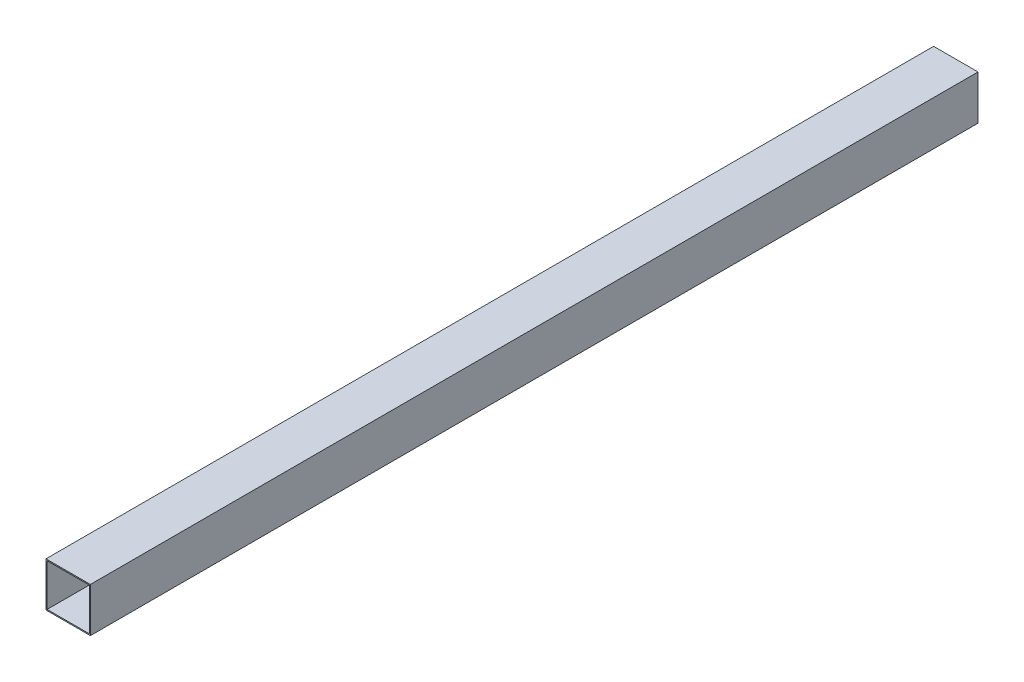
ISO-10303-21;
HEADER;
FILE_DESCRIPTION(('STEP AP214'),'2;1');
FILE_NAME('part.step','',(''),(''),'','','');
FILE_SCHEMA(('AUTOMOTIVE_DESIGN { 1 0 10303 214 1 1 1 1 }'));
ENDSEC;
DATA;
#1=APPLICATION_CONTEXT('core data for automotive mechanical design processes');
#2=APPLICATION_PROTOCOL_DEFINITION('international standard','automotive_design',2000,#1);
#3=PRODUCT_CONTEXT('',#1,'mechanical');
#4=PRODUCT('Part','Part','',(#3));
#5=PRODUCT_RELATED_PRODUCT_CATEGORY('part','',(#4));
#6=PRODUCT_DEFINITION_FORMATION('','',#4);
#7=PRODUCT_DEFINITION_CONTEXT('part definition',#1,'design');
#8=PRODUCT_DEFINITION('design','',#6,#7);
#9=PRODUCT_DEFINITION_SHAPE('','',#8);
#10=(LENGTH_UNIT() NAMED_UNIT(*) SI_UNIT(.MILLI.,.METRE.));
#11=(NAMED_UNIT(*) PLANE_ANGLE_UNIT() SI_UNIT($,.RADIAN.));
#12=(NAMED_UNIT(*) SI_UNIT($,.STERADIAN.) SOLID_ANGLE_UNIT());
#13=UNCERTAINTY_MEASURE_WITH_UNIT(LENGTH_MEASURE(1.E-05),#10,'distance_accuracy_value','');
#14=(GEOMETRIC_REPRESENTATION_CONTEXT(3) GLOBAL_UNCERTAINTY_ASSIGNED_CONTEXT((#13)) GLOBAL_UNIT_ASSIGNED_CONTEXT((#10,
#11,#12)) REPRESENTATION_CONTEXT('',''));
#15=CARTESIAN_POINT('',(0.,0.,0.));
#16=DIRECTION('',(0.,0.,1.));
#17=DIRECTION('',(1.,0.,0.));
#18=AXIS2_PLACEMENT_3D('',#15,#16,#17);
#19=CARTESIAN_POINT('',(0.,0.,800.));
#20=DIRECTION('',(0.,0.,1.));
#21=DIRECTION('',(1.,0.,0.));
#22=AXIS2_PLACEMENT_3D('',#19,#20,#21);
#23=PLANE('',#22);
#24=DIRECTION('',(0.,1.,0.));
#25=VECTOR('',#24,1.);
#26=CARTESIAN_POINT('',(20.,-20.,800.));
#27=LINE('',#26,#25);
#28=CARTESIAN_POINT('',(20.,-20.,800.));
#29=VERTEX_POINT('',#28);
#30=CARTESIAN_POINT('',(20.,20.,800.));
#31=VERTEX_POINT('',#30);
#32=EDGE_CURVE('E166',#29,#31,#27,.T.);
#33=ORIENTED_EDGE('',*,*,#32,.T.);
#34=DIRECTION('',(-1.,0.,0.));
#35=VECTOR('',#34,1.);
#36=CARTESIAN_POINT('',(-20.,20.,800.));
#37=LINE('',#36,#35);
#38=CARTESIAN_POINT('',(-20.,20.,800.));
#39=VERTEX_POINT('',#38);
#40=EDGE_CURVE('E169',#31,#39,#37,.T.);
#41=ORIENTED_EDGE('',*,*,#40,.T.);
#42=DIRECTION('',(0.,-1.,0.));
#43=VECTOR('',#42,1.);
#44=CARTESIAN_POINT('',(-20.,-20.,800.));
#45=LINE('',#44,#43);
#46=CARTESIAN_POINT('',(-20.,-20.,800.));
#47=VERTEX_POINT('',#46);
#48=EDGE_CURVE('E172',#39,#47,#45,.T.);
#49=ORIENTED_EDGE('',*,*,#48,.T.);
#50=DIRECTION('',(1.,0.,0.));
#51=VECTOR('',#50,1.);
#52=CARTESIAN_POINT('',(-20.,-20.,800.));
#53=LINE('',#52,#51);
#54=EDGE_CURVE('E174',#47,#29,#53,.T.);
#55=ORIENTED_EDGE('',*,*,#54,.T.);
#56=EDGE_LOOP('',(#33,#41,#49,#55));
#57=FACE_BOUND('',#56,.T.);
#58=DIRECTION('',(-1.,0.,0.));
#59=VECTOR('',#58,1.);
#60=CARTESIAN_POINT('',(0.,19.,800.));
#61=LINE('',#60,#59);
#62=CARTESIAN_POINT('',(19.,19.,800.));
#63=VERTEX_POINT('',#62);
#64=CARTESIAN_POINT('',(-19.,19.,800.));
#65=VERTEX_POINT('',#64);
#66=EDGE_CURVE('E138',#63,#65,#61,.T.);
#67=ORIENTED_EDGE('',*,*,#66,.F.);
#68=DIRECTION('',(0.,1.,0.));
#69=VECTOR('',#68,1.);
#70=CARTESIAN_POINT('',(19.,0.,800.));
#71=LINE('',#70,#69);
#72=CARTESIAN_POINT('',(19.,-19.,800.));
#73=VERTEX_POINT('',#72);
#74=EDGE_CURVE('E130',#73,#63,#71,.T.);
#75=ORIENTED_EDGE('',*,*,#74,.F.);
#76=DIRECTION('',(1.,0.,0.));
#77=VECTOR('',#76,1.);
#78=CARTESIAN_POINT('',(0.,-19.,800.));
#79=LINE('',#78,#77);
#80=CARTESIAN_POINT('',(-19.,-19.,800.));
#81=VERTEX_POINT('',#80);
#82=EDGE_CURVE('E152',#81,#73,#79,.T.);
#83=ORIENTED_EDGE('',*,*,#82,.F.);
#84=DIRECTION('',(0.,-1.,0.));
#85=VECTOR('',#84,1.);
#86=CARTESIAN_POINT('',(-19.,0.,800.));
#87=LINE('',#86,#85);
#88=EDGE_CURVE('E150',#65,#81,#87,.T.);
#89=ORIENTED_EDGE('',*,*,#88,.F.);
#90=EDGE_LOOP('',(#67,#75,#83,#89));
#91=FACE_BOUND('',#90,.T.);
#92=ADVANCED_FACE('F65',(#57,#91),#23,.T.);
#93=CARTESIAN_POINT('',(0.,0.,0.));
#94=DIRECTION('',(0.,0.,1.));
#95=DIRECTION('',(1.,0.,0.));
#96=AXIS2_PLACEMENT_3D('',#93,#94,#95);
#97=PLANE('',#96);
#98=DIRECTION('',(0.,1.,0.));
#99=VECTOR('',#98,1.);
#100=CARTESIAN_POINT('',(20.,-20.,0.));
#101=LINE('',#100,#99);
#102=CARTESIAN_POINT('',(20.,-20.,0.));
#103=VERTEX_POINT('',#102);
#104=CARTESIAN_POINT('',(20.,20.,0.));
#105=VERTEX_POINT('',#104);
#106=EDGE_CURVE('E146',#103,#105,#101,.T.);
#107=ORIENTED_EDGE('',*,*,#106,.F.);
#108=DIRECTION('',(1.,0.,0.));
#109=VECTOR('',#108,1.);
#110=CARTESIAN_POINT('',(-20.,-20.,0.));
#111=LINE('',#110,#109);
#112=CARTESIAN_POINT('',(-20.,-20.,0.));
#113=VERTEX_POINT('',#112);
#114=EDGE_CURVE('E170',#113,#103,#111,.T.);
#115=ORIENTED_EDGE('',*,*,#114,.F.);
#116=DIRECTION('',(0.,-1.,0.));
#117=VECTOR('',#116,1.);
#118=CARTESIAN_POINT('',(-20.,-20.,0.));
#119=LINE('',#118,#117);
#120=CARTESIAN_POINT('',(-20.,20.,0.));
#121=VERTEX_POINT('',#120);
#122=EDGE_CURVE('E181',#121,#113,#119,.T.);
#123=ORIENTED_EDGE('',*,*,#122,.F.);
#124=DIRECTION('',(-1.,0.,0.));
#125=VECTOR('',#124,1.);
#126=CARTESIAN_POINT('',(-20.,20.,0.));
#127=LINE('',#126,#125);
#128=EDGE_CURVE('E179',#105,#121,#127,.T.);
#129=ORIENTED_EDGE('',*,*,#128,.F.);
#130=EDGE_LOOP('',(#107,#115,#123,#129));
#131=FACE_BOUND('',#130,.T.);
#132=DIRECTION('',(0.,1.,0.));
#133=VECTOR('',#132,1.);
#134=CARTESIAN_POINT('',(19.,0.,0.));
#135=LINE('',#134,#133);
#136=CARTESIAN_POINT('',(19.,-19.,0.));
#137=VERTEX_POINT('',#136);
#138=CARTESIAN_POINT('',(19.,19.,0.));
#139=VERTEX_POINT('',#138);
#140=EDGE_CURVE('E88',#137,#139,#135,.T.);
#141=ORIENTED_EDGE('',*,*,#140,.T.);
#142=DIRECTION('',(-1.,0.,0.));
#143=VECTOR('',#142,1.);
#144=CARTESIAN_POINT('',(0.,19.,0.));
#145=LINE('',#144,#143);
#146=CARTESIAN_POINT('',(-19.,19.,0.));
#147=VERTEX_POINT('',#146);
#148=EDGE_CURVE('E145',#139,#147,#145,.T.);
#149=ORIENTED_EDGE('',*,*,#148,.T.);
#150=DIRECTION('',(0.,-1.,0.));
#151=VECTOR('',#150,1.);
#152=CARTESIAN_POINT('',(-19.,0.,0.));
#153=LINE('',#152,#151);
#154=CARTESIAN_POINT('',(-19.,-19.,0.));
#155=VERTEX_POINT('',#154);
#156=EDGE_CURVE('E158',#147,#155,#153,.T.);
#157=ORIENTED_EDGE('',*,*,#156,.T.);
#158=DIRECTION('',(1.,0.,0.));
#159=VECTOR('',#158,1.);
#160=CARTESIAN_POINT('',(0.,-19.,0.));
#161=LINE('',#160,#159);
#162=EDGE_CURVE('E139',#155,#137,#161,.T.);
#163=ORIENTED_EDGE('',*,*,#162,.T.);
#164=EDGE_LOOP('',(#141,#149,#157,#163));
#165=FACE_BOUND('',#164,.T.);
#166=ADVANCED_FACE('F199',(#131,#165),#97,.F.);
#167=CARTESIAN_POINT('',(20.,-20.,800.));
#168=DIRECTION('',(-1.,0.,0.));
#169=DIRECTION('',(0.,0.,1.));
#170=AXIS2_PLACEMENT_3D('',#167,#168,#169);
#171=PLANE('',#170);
#172=ORIENTED_EDGE('',*,*,#106,.T.);
#173=DIRECTION('',(0.,0.,-1.));
#174=VECTOR('',#173,1.);
#175=CARTESIAN_POINT('',(20.,20.,800.));
#176=LINE('',#175,#174);
#177=EDGE_CURVE('E12',#31,#105,#176,.T.);
#178=ORIENTED_EDGE('',*,*,#177,.F.);
#179=ORIENTED_EDGE('',*,*,#32,.F.);
#180=DIRECTION('',(0.,0.,-1.));
#181=VECTOR('',#180,1.);
#182=CARTESIAN_POINT('',(20.,-20.,800.));
#183=LINE('',#182,#181);
#184=EDGE_CURVE('E176',#29,#103,#183,.T.);
#185=ORIENTED_EDGE('',*,*,#184,.T.);
#186=EDGE_LOOP('',(#172,#178,#179,#185));
#187=FACE_BOUND('',#186,.T.);
#188=ADVANCED_FACE('F67',(#187),#171,.F.);
#189=CARTESIAN_POINT('',(-20.,20.,800.));
#190=DIRECTION('',(0.,-1.,0.));
#191=DIRECTION('',(0.,0.,-1.));
#192=AXIS2_PLACEMENT_3D('',#189,#190,#191);
#193=PLANE('',#192);
#194=ORIENTED_EDGE('',*,*,#128,.T.);
#195=DIRECTION('',(0.,0.,-1.));
#196=VECTOR('',#195,1.);
#197=CARTESIAN_POINT('',(-20.,20.,800.));
#198=LINE('',#197,#196);
#199=EDGE_CURVE('E73',#39,#121,#198,.T.);
#200=ORIENTED_EDGE('',*,*,#199,.F.);
#201=ORIENTED_EDGE('',*,*,#40,.F.);
#202=ORIENTED_EDGE('',*,*,#177,.T.);
#203=EDGE_LOOP('',(#194,#200,#201,#202));
#204=FACE_BOUND('',#203,.T.);
#205=ADVANCED_FACE('F209',(#204),#193,.F.);
#206=CARTESIAN_POINT('',(-20.,-20.,800.));
#207=DIRECTION('',(1.,0.,0.));
#208=DIRECTION('',(0.,0.,-1.));
#209=AXIS2_PLACEMENT_3D('',#206,#207,#208);
#210=PLANE('',#209);
#211=ORIENTED_EDGE('',*,*,#122,.T.);
#212=DIRECTION('',(0.,0.,-1.));
#213=VECTOR('',#212,1.);
#214=CARTESIAN_POINT('',(-20.,-20.,800.));
#215=LINE('',#214,#213);
#216=EDGE_CURVE('E186',#47,#113,#215,.T.);
#217=ORIENTED_EDGE('',*,*,#216,.F.);
#218=ORIENTED_EDGE('',*,*,#48,.F.);
#219=ORIENTED_EDGE('',*,*,#199,.T.);
#220=EDGE_LOOP('',(#211,#217,#218,#219));
#221=FACE_BOUND('',#220,.T.);
#222=ADVANCED_FACE('F193',(#221),#210,.F.);
#223=CARTESIAN_POINT('',(-20.,-20.,800.));
#224=DIRECTION('',(0.,1.,0.));
#225=DIRECTION('',(0.,0.,1.));
#226=AXIS2_PLACEMENT_3D('',#223,#224,#225);
#227=PLANE('',#226);
#228=ORIENTED_EDGE('',*,*,#114,.T.);
#229=ORIENTED_EDGE('',*,*,#184,.F.);
#230=ORIENTED_EDGE('',*,*,#54,.F.);
#231=ORIENTED_EDGE('',*,*,#216,.T.);
#232=EDGE_LOOP('',(#228,#229,#230,#231));
#233=FACE_BOUND('',#232,.T.);
#234=ADVANCED_FACE('F203',(#233),#227,.F.);
#235=CARTESIAN_POINT('',(19.,0.,800.));
#236=DIRECTION('',(-1.,0.,0.));
#237=DIRECTION('',(0.,0.,1.));
#238=AXIS2_PLACEMENT_3D('',#235,#236,#237);
#239=PLANE('',#238);
#240=ORIENTED_EDGE('',*,*,#140,.F.);
#241=DIRECTION('',(0.,0.,-1.));
#242=VECTOR('',#241,1.);
#243=CARTESIAN_POINT('',(19.,-19.,800.));
#244=LINE('',#243,#242);
#245=EDGE_CURVE('E134',#73,#137,#244,.T.);
#246=ORIENTED_EDGE('',*,*,#245,.F.);
#247=ORIENTED_EDGE('',*,*,#74,.T.);
#248=DIRECTION('',(0.,0.,-1.));
#249=VECTOR('',#248,1.);
#250=CARTESIAN_POINT('',(19.,19.,800.));
#251=LINE('',#250,#249);
#252=EDGE_CURVE('E133',#63,#139,#251,.T.);
#253=ORIENTED_EDGE('',*,*,#252,.T.);
#254=EDGE_LOOP('',(#240,#246,#247,#253));
#255=FACE_BOUND('',#254,.T.);
#256=ADVANCED_FACE('F132',(#255),#239,.T.);
#257=CARTESIAN_POINT('',(0.,19.,800.));
#258=DIRECTION('',(0.,-1.,0.));
#259=DIRECTION('',(0.,0.,-1.));
#260=AXIS2_PLACEMENT_3D('',#257,#258,#259);
#261=PLANE('',#260);
#262=ORIENTED_EDGE('',*,*,#148,.F.);
#263=ORIENTED_EDGE('',*,*,#252,.F.);
#264=ORIENTED_EDGE('',*,*,#66,.T.);
#265=DIRECTION('',(0.,0.,-1.));
#266=VECTOR('',#265,1.);
#267=CARTESIAN_POINT('',(-19.,19.,800.));
#268=LINE('',#267,#266);
#269=EDGE_CURVE('E147',#65,#147,#268,.T.);
#270=ORIENTED_EDGE('',*,*,#269,.T.);
#271=EDGE_LOOP('',(#262,#263,#264,#270));
#272=FACE_BOUND('',#271,.T.);
#273=ADVANCED_FACE('F142',(#272),#261,.T.);
#274=CARTESIAN_POINT('',(-19.,0.,800.));
#275=DIRECTION('',(1.,0.,0.));
#276=DIRECTION('',(0.,0.,-1.));
#277=AXIS2_PLACEMENT_3D('',#274,#275,#276);
#278=PLANE('',#277);
#279=ORIENTED_EDGE('',*,*,#156,.F.);
#280=ORIENTED_EDGE('',*,*,#269,.F.);
#281=ORIENTED_EDGE('',*,*,#88,.T.);
#282=DIRECTION('',(0.,0.,-1.));
#283=VECTOR('',#282,1.);
#284=CARTESIAN_POINT('',(-19.,-19.,800.));
#285=LINE('',#284,#283);
#286=EDGE_CURVE('E80',#81,#155,#285,.T.);
#287=ORIENTED_EDGE('',*,*,#286,.T.);
#288=EDGE_LOOP('',(#279,#280,#281,#287));
#289=FACE_BOUND('',#288,.T.);
#290=ADVANCED_FACE('F232',(#289),#278,.T.);
#291=CARTESIAN_POINT('',(0.,-19.,800.));
#292=DIRECTION('',(0.,1.,0.));
#293=DIRECTION('',(0.,0.,1.));
#294=AXIS2_PLACEMENT_3D('',#291,#292,#293);
#295=PLANE('',#294);
#296=ORIENTED_EDGE('',*,*,#162,.F.);
#297=ORIENTED_EDGE('',*,*,#286,.F.);
#298=ORIENTED_EDGE('',*,*,#82,.T.);
#299=ORIENTED_EDGE('',*,*,#245,.T.);
#300=EDGE_LOOP('',(#296,#297,#298,#299));
#301=FACE_BOUND('',#300,.T.);
#302=ADVANCED_FACE('F236',(#301),#295,.T.);
#303=CLOSED_SHELL('',(#92,#166,#188,#205,#222,#234,#256,#273,#290,#302));
#304=MANIFOLD_SOLID_BREP('B2',#303);
#305=ADVANCED_BREP_SHAPE_REPRESENTATION('',(#18,#304),#14);
#306=SHAPE_DEFINITION_REPRESENTATION(#9,#305);
ENDSEC;
END-ISO-10303-21;
